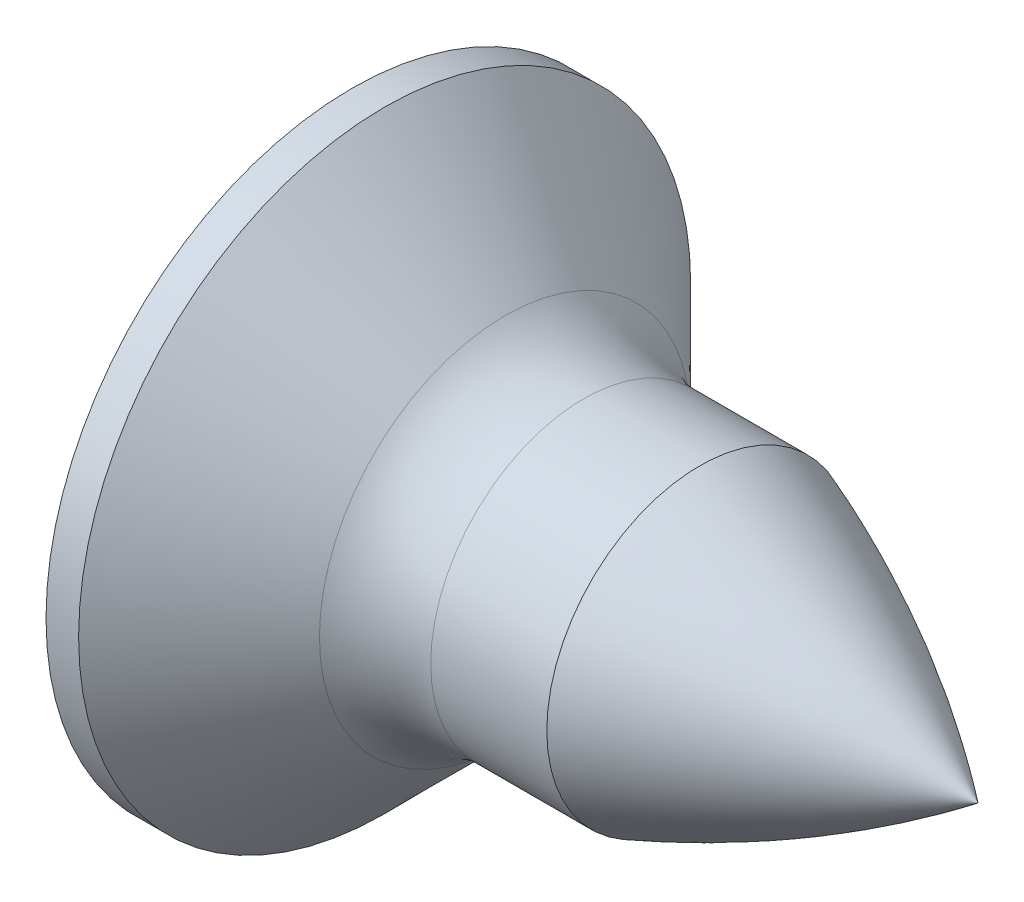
ISO-10303-21;
HEADER;
FILE_DESCRIPTION(('STEP AP214'),'2;1');
FILE_NAME('part.step','',(''),(''),'','','');
FILE_SCHEMA(('AUTOMOTIVE_DESIGN { 1 0 10303 214 1 1 1 1 }'));
ENDSEC;
DATA;
#1=APPLICATION_CONTEXT('core data for automotive mechanical design processes');
#2=APPLICATION_PROTOCOL_DEFINITION('international standard','automotive_design',2000,#1);
#3=PRODUCT_CONTEXT('',#1,'mechanical');
#4=PRODUCT('Part','Part','',(#3));
#5=PRODUCT_RELATED_PRODUCT_CATEGORY('part','',(#4));
#6=PRODUCT_DEFINITION_FORMATION('','',#4);
#7=PRODUCT_DEFINITION_CONTEXT('part definition',#1,'design');
#8=PRODUCT_DEFINITION('design','',#6,#7);
#9=PRODUCT_DEFINITION_SHAPE('','',#8);
#10=(LENGTH_UNIT() NAMED_UNIT(*) SI_UNIT(.MILLI.,.METRE.));
#11=(NAMED_UNIT(*) PLANE_ANGLE_UNIT() SI_UNIT($,.RADIAN.));
#12=(NAMED_UNIT(*) SI_UNIT($,.STERADIAN.) SOLID_ANGLE_UNIT());
#13=UNCERTAINTY_MEASURE_WITH_UNIT(LENGTH_MEASURE(1.E-05),#10,'distance_accuracy_value','');
#14=(GEOMETRIC_REPRESENTATION_CONTEXT(3) GLOBAL_UNCERTAINTY_ASSIGNED_CONTEXT((#13)) GLOBAL_UNIT_ASSIGNED_CONTEXT((#10,
#11,#12)) REPRESENTATION_CONTEXT('',''));
#15=CARTESIAN_POINT('',(0.,0.,0.));
#16=DIRECTION('',(0.,0.,1.));
#17=DIRECTION('',(1.,0.,0.));
#18=AXIS2_PLACEMENT_3D('',#15,#16,#17);
#19=CARTESIAN_POINT('',(-96.3851955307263,0.,0.));
#20=DIRECTION('',(-1.,0.,0.));
#21=DIRECTION('',(0.,0.,1.));
#22=AXIS2_PLACEMENT_3D('',#19,#20,#21);
#23=CYLINDRICAL_SURFACE('',#22,1.09999999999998);
#24=CARTESIAN_POINT('',(1.66568542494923,0.,0.));
#25=DIRECTION('',(-1.,0.,0.));
#26=DIRECTION('',(0.,0.,1.));
#27=AXIS2_PLACEMENT_3D('',#24,#25,#26);
#28=CIRCLE('',#27,1.09999999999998);
#29=CARTESIAN_POINT('',(1.66568542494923,0.,1.09999999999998));
#30=VERTEX_POINT('',#29);
#31=EDGE_CURVE('E11',#30,#30,#28,.T.);
#32=ORIENTED_EDGE('',*,*,#31,.F.);
#33=EDGE_LOOP('',(#32));
#34=FACE_BOUND('',#33,.T.);
#35=CARTESIAN_POINT('',(2.5,0.,0.));
#36=DIRECTION('',(1.,0.,0.));
#37=DIRECTION('',(0.,0.,-1.));
#38=AXIS2_PLACEMENT_3D('',#35,#36,#37);
#39=CIRCLE('',#38,1.1);
#40=CARTESIAN_POINT('',(2.5,0.,-1.09999999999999));
#41=VERTEX_POINT('',#40);
#42=EDGE_CURVE('E286',#41,#41,#39,.T.);
#43=ORIENTED_EDGE('',*,*,#42,.F.);
#44=EDGE_LOOP('',(#43));
#45=FACE_BOUND('',#44,.T.);
#46=ADVANCED_FACE('F37',(#34,#45),#23,.T.);
#47=CARTESIAN_POINT('',(1.66568542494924,0.,0.));
#48=DIRECTION('',(-1.,0.,0.));
#49=DIRECTION('',(0.,0.,1.));
#50=AXIS2_PLACEMENT_3D('',#47,#48,#49);
#51=TOROIDAL_SURFACE('',#50,1.89999999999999,0.800000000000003);
#52=CARTESIAN_POINT('',(1.1,0.,0.));
#53=DIRECTION('',(-1.,0.,0.));
#54=DIRECTION('',(0.,0.,1.));
#55=AXIS2_PLACEMENT_3D('',#52,#53,#54);
#56=CIRCLE('',#55,1.33431457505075);
#57=CARTESIAN_POINT('',(1.1,0.,1.33431457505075));
#58=VERTEX_POINT('',#57);
#59=EDGE_CURVE('E244',#58,#58,#56,.T.);
#60=ORIENTED_EDGE('',*,*,#59,.F.);
#61=EDGE_LOOP('',(#60));
#62=FACE_BOUND('',#61,.T.);
#63=ORIENTED_EDGE('',*,*,#31,.T.);
#64=EDGE_LOOP('',(#63));
#65=FACE_BOUND('',#64,.T.);
#66=ADVANCED_FACE('F155',(#62,#65),#51,.F.);
#67=CARTESIAN_POINT('',(0.,2.19999999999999,0.));
#68=DIRECTION('',(1.,0.,0.));
#69=DIRECTION('',(0.,0.,-1.));
#70=AXIS2_PLACEMENT_3D('',#67,#68,#69);
#71=PLANE('',#70);
#72=DIRECTION('',(0.,0.,-1.));
#73=VECTOR('',#72,1.);
#74=CARTESIAN_POINT('',(-1.13686837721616E-10,0.199999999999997,-0.199999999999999));
#75=LINE('',#74,#73);
#76=CARTESIAN_POINT('',(0.,0.199999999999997,-0.199999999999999));
#77=VERTEX_POINT('',#76);
#78=CARTESIAN_POINT('',(-1.13686837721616E-10,0.199999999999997,-1.));
#79=VERTEX_POINT('',#78);
#80=EDGE_CURVE('E204',#77,#79,#75,.T.);
#81=ORIENTED_EDGE('',*,*,#80,.F.);
#82=DIRECTION('',(0.,-1.,0.));
#83=VECTOR('',#82,1.);
#84=CARTESIAN_POINT('',(-1.13686837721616E-10,1.,-0.199999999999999));
#85=LINE('',#84,#83);
#86=CARTESIAN_POINT('',(-1.13686837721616E-10,1.,-0.199999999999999));
#87=VERTEX_POINT('',#86);
#88=EDGE_CURVE('E56',#87,#77,#85,.T.);
#89=ORIENTED_EDGE('',*,*,#88,.F.);
#90=DIRECTION('',(0.,0.,-1.));
#91=VECTOR('',#90,1.);
#92=CARTESIAN_POINT('',(-1.13686837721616E-10,1.,0.199999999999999));
#93=LINE('',#92,#91);
#94=CARTESIAN_POINT('',(-1.13686837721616E-10,1.,0.199999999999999));
#95=VERTEX_POINT('',#94);
#96=EDGE_CURVE('E232',#95,#87,#93,.T.);
#97=ORIENTED_EDGE('',*,*,#96,.F.);
#98=DIRECTION('',(0.,1.,0.));
#99=VECTOR('',#98,1.);
#100=CARTESIAN_POINT('',(-1.13686837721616E-10,1.,0.199999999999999));
#101=LINE('',#100,#99);
#102=CARTESIAN_POINT('',(-1.13686837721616E-10,0.199999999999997,0.199999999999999));
#103=VERTEX_POINT('',#102);
#104=EDGE_CURVE('E230',#103,#95,#101,.T.);
#105=ORIENTED_EDGE('',*,*,#104,.F.);
#106=DIRECTION('',(0.,0.,-1.));
#107=VECTOR('',#106,1.);
#108=CARTESIAN_POINT('',(-1.13686837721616E-10,0.199999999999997,0.199999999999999));
#109=LINE('',#108,#107);
#110=CARTESIAN_POINT('',(-1.13686837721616E-10,0.199999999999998,1.));
#111=VERTEX_POINT('',#110);
#112=EDGE_CURVE('E227',#111,#103,#109,.T.);
#113=ORIENTED_EDGE('',*,*,#112,.F.);
#114=DIRECTION('',(0.,1.,0.));
#115=VECTOR('',#114,1.);
#116=CARTESIAN_POINT('',(-1.13686837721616E-10,0.199999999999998,1.));
#117=LINE('',#116,#115);
#118=CARTESIAN_POINT('',(-1.13686837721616E-10,-0.199999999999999,1.));
#119=VERTEX_POINT('',#118);
#120=EDGE_CURVE('E224',#119,#111,#117,.T.);
#121=ORIENTED_EDGE('',*,*,#120,.F.);
#122=DIRECTION('',(0.,0.,1.));
#123=VECTOR('',#122,1.);
#124=CARTESIAN_POINT('',(-1.13686837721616E-10,-0.199999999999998,0.199999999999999));
#125=LINE('',#124,#123);
#126=CARTESIAN_POINT('',(-1.13686837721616E-10,-0.199999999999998,0.199999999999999));
#127=VERTEX_POINT('',#126);
#128=EDGE_CURVE('E222',#127,#119,#125,.T.);
#129=ORIENTED_EDGE('',*,*,#128,.F.);
#130=DIRECTION('',(0.,1.,0.));
#131=VECTOR('',#130,1.);
#132=CARTESIAN_POINT('',(-1.13686837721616E-10,-1.,0.199999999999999));
#133=LINE('',#132,#131);
#134=CARTESIAN_POINT('',(-1.13686837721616E-10,-1.,0.199999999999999));
#135=VERTEX_POINT('',#134);
#136=EDGE_CURVE('E220',#135,#127,#133,.T.);
#137=ORIENTED_EDGE('',*,*,#136,.F.);
#138=DIRECTION('',(0.,0.,1.));
#139=VECTOR('',#138,1.);
#140=CARTESIAN_POINT('',(-1.13686837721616E-10,-1.,0.199999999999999));
#141=LINE('',#140,#139);
#142=CARTESIAN_POINT('',(-1.13686837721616E-10,-1.,-0.199999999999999));
#143=VERTEX_POINT('',#142);
#144=EDGE_CURVE('E214',#143,#135,#141,.T.);
#145=ORIENTED_EDGE('',*,*,#144,.F.);
#146=DIRECTION('',(0.,-1.,0.));
#147=VECTOR('',#146,1.);
#148=CARTESIAN_POINT('',(-1.13686837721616E-10,-1.,-0.199999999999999));
#149=LINE('',#148,#147);
#150=CARTESIAN_POINT('',(-1.13686837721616E-10,-0.199999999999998,-0.199999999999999));
#151=VERTEX_POINT('',#150);
#152=EDGE_CURVE('E211',#151,#143,#149,.T.);
#153=ORIENTED_EDGE('',*,*,#152,.F.);
#154=DIRECTION('',(0.,0.,1.));
#155=VECTOR('',#154,1.);
#156=CARTESIAN_POINT('',(-1.13686837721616E-10,-0.199999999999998,-0.199999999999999));
#157=LINE('',#156,#155);
#158=CARTESIAN_POINT('',(-1.13686837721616E-10,-0.2,-1.));
#159=VERTEX_POINT('',#158);
#160=EDGE_CURVE('E203',#159,#151,#157,.T.);
#161=ORIENTED_EDGE('',*,*,#160,.F.);
#162=DIRECTION('',(0.,-1.,0.));
#163=VECTOR('',#162,1.);
#164=CARTESIAN_POINT('',(-1.13686837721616E-10,0.199999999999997,-1.));
#165=LINE('',#164,#163);
#166=EDGE_CURVE('E194',#79,#159,#165,.T.);
#167=ORIENTED_EDGE('',*,*,#166,.F.);
#168=EDGE_LOOP('',(#81,#89,#97,#105,#113,#121,#129,#137,#145,#153,#161,#167));
#169=FACE_BOUND('',#168,.T.);
#170=CARTESIAN_POINT('',(0.,0.,0.));
#171=DIRECTION('',(-1.,0.,0.));
#172=DIRECTION('',(0.,0.,1.));
#173=AXIS2_PLACEMENT_3D('',#170,#171,#172);
#174=CIRCLE('',#173,2.19999999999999);
#175=CARTESIAN_POINT('',(0.,0.,2.19999999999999));
#176=VERTEX_POINT('',#175);
#177=EDGE_CURVE('E47',#176,#176,#174,.T.);
#178=ORIENTED_EDGE('',*,*,#177,.T.);
#179=EDGE_LOOP('',(#178));
#180=FACE_BOUND('',#179,.T.);
#181=ADVANCED_FACE('F161',(#169,#180),#71,.F.);
#182=CARTESIAN_POINT('',(-96.3851955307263,0.,0.));
#183=DIRECTION('',(-1.,0.,0.));
#184=DIRECTION('',(0.,0.,1.));
#185=AXIS2_PLACEMENT_3D('',#182,#183,#184);
#186=CYLINDRICAL_SURFACE('',#185,2.19999999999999);
#187=ORIENTED_EDGE('',*,*,#177,.F.);
#188=EDGE_LOOP('',(#187));
#189=FACE_BOUND('',#188,.T.);
#190=CARTESIAN_POINT('',(0.234314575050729,0.,0.));
#191=DIRECTION('',(-1.,0.,0.));
#192=DIRECTION('',(0.,0.,1.));
#193=AXIS2_PLACEMENT_3D('',#190,#191,#192);
#194=CIRCLE('',#193,2.19999999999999);
#195=CARTESIAN_POINT('',(0.234314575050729,0.,2.19999999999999));
#196=VERTEX_POINT('',#195);
#197=EDGE_CURVE('E247',#196,#196,#194,.T.);
#198=ORIENTED_EDGE('',*,*,#197,.T.);
#199=EDGE_LOOP('',(#198));
#200=FACE_BOUND('',#199,.T.);
#201=ADVANCED_FACE('F322',(#189,#200),#186,.T.);
#202=CARTESIAN_POINT('',(1.1,0.,0.));
#203=DIRECTION('',(-1.,0.,0.));
#204=DIRECTION('',(0.,0.,1.));
#205=AXIS2_PLACEMENT_3D('',#202,#203,#204);
#206=CONICAL_SURFACE('',#205,1.33431457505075,0.78539816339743);
#207=ORIENTED_EDGE('',*,*,#197,.F.);
#208=EDGE_LOOP('',(#207));
#209=FACE_BOUND('',#208,.T.);
#210=ORIENTED_EDGE('',*,*,#59,.T.);
#211=EDGE_LOOP('',(#210));
#212=FACE_BOUND('',#211,.T.);
#213=ADVANCED_FACE('F320',(#209,#212),#206,.T.);
#214=CARTESIAN_POINT('',(0.949999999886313,1.,-0.199999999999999));
#215=DIRECTION('',(0.,0.,-1.));
#216=DIRECTION('',(-1.,0.,0.));
#217=AXIS2_PLACEMENT_3D('',#214,#215,#216);
#218=PLANE('',#217);
#219=ORIENTED_EDGE('',*,*,#88,.T.);
#220=DIRECTION('',(-1.,0.,0.));
#221=VECTOR('',#220,1.);
#222=CARTESIAN_POINT('',(0.949999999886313,0.199999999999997,-0.199999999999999));
#223=LINE('',#222,#221);
#224=CARTESIAN_POINT('',(0.949999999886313,0.199999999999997,-0.199999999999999));
#225=VERTEX_POINT('',#224);
#226=EDGE_CURVE('E137',#225,#77,#223,.T.);
#227=ORIENTED_EDGE('',*,*,#226,.F.);
#228=DIRECTION('',(0.,-1.,0.));
#229=VECTOR('',#228,1.);
#230=CARTESIAN_POINT('',(0.949999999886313,1.,-0.199999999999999));
#231=LINE('',#230,#229);
#232=CARTESIAN_POINT('',(0.949999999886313,0.451517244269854,-0.199999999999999));
#233=VERTEX_POINT('',#232);
#234=EDGE_CURVE('E234',#233,#225,#231,.T.);
#235=ORIENTED_EDGE('',*,*,#234,.F.);
#236=DIRECTION('',(0.866025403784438,-0.500000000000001,0.));
#237=VECTOR('',#236,1.);
#238=CARTESIAN_POINT('',(-1.13686837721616E-10,1.,-0.199999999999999));
#239=LINE('',#238,#237);
#240=EDGE_CURVE('E136',#233,#87,#239,.F.);
#241=ORIENTED_EDGE('',*,*,#240,.T.);
#242=EDGE_LOOP('',(#219,#227,#235,#241));
#243=FACE_BOUND('',#242,.T.);
#244=ADVANCED_FACE('F291',(#243),#218,.F.);
#245=CARTESIAN_POINT('',(-1.13686837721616E-10,1.,0.199999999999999));
#246=DIRECTION('',(-0.500000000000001,-0.866025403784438,0.));
#247=DIRECTION('',(0.866025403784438,-0.500000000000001,0.));
#248=AXIS2_PLACEMENT_3D('',#245,#246,#247);
#249=PLANE('',#248);
#250=ORIENTED_EDGE('',*,*,#96,.T.);
#251=ORIENTED_EDGE('',*,*,#240,.F.);
#252=DIRECTION('',(0.,0.,1.));
#253=VECTOR('',#252,1.);
#254=CARTESIAN_POINT('',(0.949999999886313,0.451517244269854,0.199999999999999));
#255=LINE('',#254,#253);
#256=CARTESIAN_POINT('',(0.949999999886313,0.451517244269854,0.199999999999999));
#257=VERTEX_POINT('',#256);
#258=EDGE_CURVE('E243',#257,#233,#255,.F.);
#259=ORIENTED_EDGE('',*,*,#258,.F.);
#260=DIRECTION('',(0.866025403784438,-0.500000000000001,0.));
#261=VECTOR('',#260,1.);
#262=CARTESIAN_POINT('',(0.712499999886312,0.588637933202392,0.199999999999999));
#263=LINE('',#262,#261);
#264=EDGE_CURVE('E133',#257,#95,#263,.F.);
#265=ORIENTED_EDGE('',*,*,#264,.T.);
#266=EDGE_LOOP('',(#250,#251,#259,#265));
#267=FACE_BOUND('',#266,.T.);
#268=ADVANCED_FACE('F39',(#267),#249,.T.);
#269=CARTESIAN_POINT('',(0.949999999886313,1.,0.199999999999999));
#270=DIRECTION('',(0.,0.,1.));
#271=DIRECTION('',(1.,0.,0.));
#272=AXIS2_PLACEMENT_3D('',#269,#270,#271);
#273=PLANE('',#272);
#274=ORIENTED_EDGE('',*,*,#104,.T.);
#275=ORIENTED_EDGE('',*,*,#264,.F.);
#276=DIRECTION('',(0.,1.,0.));
#277=VECTOR('',#276,1.);
#278=CARTESIAN_POINT('',(0.949999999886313,1.,0.199999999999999));
#279=LINE('',#278,#277);
#280=CARTESIAN_POINT('',(0.949999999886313,0.199999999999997,0.199999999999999));
#281=VERTEX_POINT('',#280);
#282=EDGE_CURVE('E263',#281,#257,#279,.T.);
#283=ORIENTED_EDGE('',*,*,#282,.F.);
#284=DIRECTION('',(-1.,0.,0.));
#285=VECTOR('',#284,1.);
#286=CARTESIAN_POINT('',(0.949999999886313,0.199999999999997,0.199999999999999));
#287=LINE('',#286,#285);
#288=EDGE_CURVE('E235',#281,#103,#287,.T.);
#289=ORIENTED_EDGE('',*,*,#288,.T.);
#290=EDGE_LOOP('',(#274,#275,#283,#289));
#291=FACE_BOUND('',#290,.T.);
#292=ADVANCED_FACE('F297',(#291),#273,.F.);
#293=CARTESIAN_POINT('',(0.949999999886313,0.199999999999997,0.199999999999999));
#294=DIRECTION('',(0.,1.,0.));
#295=DIRECTION('',(0.,0.,1.));
#296=AXIS2_PLACEMENT_3D('',#293,#294,#295);
#297=PLANE('',#296);
#298=ORIENTED_EDGE('',*,*,#112,.T.);
#299=ORIENTED_EDGE('',*,*,#288,.F.);
#300=DIRECTION('',(0.,0.,-1.));
#301=VECTOR('',#300,1.);
#302=CARTESIAN_POINT('',(0.949999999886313,0.199999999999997,0.199999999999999));
#303=LINE('',#302,#301);
#304=CARTESIAN_POINT('',(0.949999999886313,0.199999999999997,0.451517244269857));
#305=VERTEX_POINT('',#304);
#306=EDGE_CURVE('E274',#305,#281,#303,.T.);
#307=ORIENTED_EDGE('',*,*,#306,.F.);
#308=DIRECTION('',(0.866025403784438,0.,-0.500000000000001));
#309=VECTOR('',#308,1.);
#310=CARTESIAN_POINT('',(-1.13686837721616E-10,0.199999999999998,1.));
#311=LINE('',#310,#309);
#312=EDGE_CURVE('E41',#305,#111,#311,.F.);
#313=ORIENTED_EDGE('',*,*,#312,.T.);
#314=EDGE_LOOP('',(#298,#299,#307,#313));
#315=FACE_BOUND('',#314,.T.);
#316=ADVANCED_FACE('F178',(#315),#297,.F.);
#317=CARTESIAN_POINT('',(-1.13686837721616E-10,0.199999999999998,1.));
#318=DIRECTION('',(-0.500000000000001,0.,-0.866025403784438));
#319=DIRECTION('',(-0.866025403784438,0.,0.500000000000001));
#320=AXIS2_PLACEMENT_3D('',#317,#318,#319);
#321=PLANE('',#320);
#322=ORIENTED_EDGE('',*,*,#120,.T.);
#323=ORIENTED_EDGE('',*,*,#312,.F.);
#324=DIRECTION('',(0.,-1.,0.));
#325=VECTOR('',#324,1.);
#326=CARTESIAN_POINT('',(0.949999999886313,0.199999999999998,0.451517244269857));
#327=LINE('',#326,#325);
#328=CARTESIAN_POINT('',(0.949999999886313,-0.199999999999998,0.451517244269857));
#329=VERTEX_POINT('',#328);
#330=EDGE_CURVE('E272',#329,#305,#327,.F.);
#331=ORIENTED_EDGE('',*,*,#330,.F.);
#332=DIRECTION('',(0.866025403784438,0.,-0.500000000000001));
#333=VECTOR('',#332,1.);
#334=CARTESIAN_POINT('',(1.05891016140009,-0.199999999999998,0.388637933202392));
#335=LINE('',#334,#333);
#336=EDGE_CURVE('E88',#329,#119,#335,.F.);
#337=ORIENTED_EDGE('',*,*,#336,.T.);
#338=EDGE_LOOP('',(#322,#323,#331,#337));
#339=FACE_BOUND('',#338,.T.);
#340=ADVANCED_FACE('F175',(#339),#321,.T.);
#341=CARTESIAN_POINT('',(0.949999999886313,-0.199999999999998,0.199999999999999));
#342=DIRECTION('',(0.,-1.,0.));
#343=DIRECTION('',(0.,0.,-1.));
#344=AXIS2_PLACEMENT_3D('',#341,#342,#343);
#345=PLANE('',#344);
#346=ORIENTED_EDGE('',*,*,#128,.T.);
#347=ORIENTED_EDGE('',*,*,#336,.F.);
#348=DIRECTION('',(0.,0.,1.));
#349=VECTOR('',#348,1.);
#350=CARTESIAN_POINT('',(0.949999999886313,-0.199999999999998,0.199999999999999));
#351=LINE('',#350,#349);
#352=CARTESIAN_POINT('',(0.949999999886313,-0.199999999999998,0.199999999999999));
#353=VERTEX_POINT('',#352);
#354=EDGE_CURVE('E275',#353,#329,#351,.T.);
#355=ORIENTED_EDGE('',*,*,#354,.F.);
#356=DIRECTION('',(-1.,0.,0.));
#357=VECTOR('',#356,1.);
#358=CARTESIAN_POINT('',(0.949999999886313,-0.199999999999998,0.199999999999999));
#359=LINE('',#358,#357);
#360=EDGE_CURVE('E97',#353,#127,#359,.T.);
#361=ORIENTED_EDGE('',*,*,#360,.T.);
#362=EDGE_LOOP('',(#346,#347,#355,#361));
#363=FACE_BOUND('',#362,.T.);
#364=ADVANCED_FACE('F177',(#363),#345,.F.);
#365=CARTESIAN_POINT('',(0.949999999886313,-1.,0.199999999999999));
#366=DIRECTION('',(0.,0.,1.));
#367=DIRECTION('',(1.,0.,0.));
#368=AXIS2_PLACEMENT_3D('',#365,#366,#367);
#369=PLANE('',#368);
#370=ORIENTED_EDGE('',*,*,#136,.T.);
#371=ORIENTED_EDGE('',*,*,#360,.F.);
#372=DIRECTION('',(0.,1.,0.));
#373=VECTOR('',#372,1.);
#374=CARTESIAN_POINT('',(0.949999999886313,-1.,0.199999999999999));
#375=LINE('',#374,#373);
#376=CARTESIAN_POINT('',(0.949999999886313,-0.451517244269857,0.199999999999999));
#377=VERTEX_POINT('',#376);
#378=EDGE_CURVE('E257',#377,#353,#375,.T.);
#379=ORIENTED_EDGE('',*,*,#378,.F.);
#380=DIRECTION('',(0.866025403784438,0.500000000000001,0.));
#381=VECTOR('',#380,1.);
#382=CARTESIAN_POINT('',(-1.13686837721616E-10,-1.,0.199999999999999));
#383=LINE('',#382,#381);
#384=EDGE_CURVE('E238',#377,#135,#383,.F.);
#385=ORIENTED_EDGE('',*,*,#384,.T.);
#386=EDGE_LOOP('',(#370,#371,#379,#385));
#387=FACE_BOUND('',#386,.T.);
#388=ADVANCED_FACE('F173',(#387),#369,.F.);
#389=CARTESIAN_POINT('',(-1.13686837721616E-10,-1.,0.199999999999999));
#390=DIRECTION('',(-0.500000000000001,0.866025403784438,0.));
#391=DIRECTION('',(-0.866025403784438,-0.500000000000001,0.));
#392=AXIS2_PLACEMENT_3D('',#389,#390,#391);
#393=PLANE('',#392);
#394=ORIENTED_EDGE('',*,*,#144,.T.);
#395=ORIENTED_EDGE('',*,*,#384,.F.);
#396=DIRECTION('',(0.,0.,-1.));
#397=VECTOR('',#396,1.);
#398=CARTESIAN_POINT('',(0.949999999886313,-0.451517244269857,0.199999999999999));
#399=LINE('',#398,#397);
#400=CARTESIAN_POINT('',(0.949999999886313,-0.451517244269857,-0.199999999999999));
#401=VERTEX_POINT('',#400);
#402=EDGE_CURVE('E254',#401,#377,#399,.F.);
#403=ORIENTED_EDGE('',*,*,#402,.F.);
#404=DIRECTION('',(0.866025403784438,0.500000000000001,0.));
#405=VECTOR('',#404,1.);
#406=CARTESIAN_POINT('',(0.712499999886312,-0.588637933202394,-0.199999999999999));
#407=LINE('',#406,#405);
#408=EDGE_CURVE('E241',#401,#143,#407,.F.);
#409=ORIENTED_EDGE('',*,*,#408,.T.);
#410=EDGE_LOOP('',(#394,#395,#403,#409));
#411=FACE_BOUND('',#410,.T.);
#412=ADVANCED_FACE('F169',(#411),#393,.T.);
#413=CARTESIAN_POINT('',(0.949999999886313,-1.,-0.199999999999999));
#414=DIRECTION('',(0.,0.,-1.));
#415=DIRECTION('',(-1.,0.,0.));
#416=AXIS2_PLACEMENT_3D('',#413,#414,#415);
#417=PLANE('',#416);
#418=ORIENTED_EDGE('',*,*,#152,.T.);
#419=ORIENTED_EDGE('',*,*,#408,.F.);
#420=DIRECTION('',(0.,-1.,0.));
#421=VECTOR('',#420,1.);
#422=CARTESIAN_POINT('',(0.949999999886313,-1.,-0.199999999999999));
#423=LINE('',#422,#421);
#424=CARTESIAN_POINT('',(0.949999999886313,-0.199999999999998,-0.199999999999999));
#425=VERTEX_POINT('',#424);
#426=EDGE_CURVE('E258',#425,#401,#423,.T.);
#427=ORIENTED_EDGE('',*,*,#426,.F.);
#428=DIRECTION('',(-1.,0.,0.));
#429=VECTOR('',#428,1.);
#430=CARTESIAN_POINT('',(0.949999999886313,-0.199999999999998,-0.199999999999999));
#431=LINE('',#430,#429);
#432=EDGE_CURVE('E239',#425,#151,#431,.T.);
#433=ORIENTED_EDGE('',*,*,#432,.T.);
#434=EDGE_LOOP('',(#418,#419,#427,#433));
#435=FACE_BOUND('',#434,.T.);
#436=ADVANCED_FACE('F172',(#435),#417,.F.);
#437=CARTESIAN_POINT('',(0.949999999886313,-0.199999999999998,-0.199999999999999));
#438=DIRECTION('',(0.,-1.,0.));
#439=DIRECTION('',(0.,0.,-1.));
#440=AXIS2_PLACEMENT_3D('',#437,#438,#439);
#441=PLANE('',#440);
#442=ORIENTED_EDGE('',*,*,#160,.T.);
#443=ORIENTED_EDGE('',*,*,#432,.F.);
#444=DIRECTION('',(0.,0.,1.));
#445=VECTOR('',#444,1.);
#446=CARTESIAN_POINT('',(0.949999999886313,-0.199999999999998,-0.199999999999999));
#447=LINE('',#446,#445);
#448=CARTESIAN_POINT('',(0.949999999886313,-0.199999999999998,-0.451517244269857));
#449=VERTEX_POINT('',#448);
#450=EDGE_CURVE('E269',#449,#425,#447,.T.);
#451=ORIENTED_EDGE('',*,*,#450,.F.);
#452=DIRECTION('',(0.866025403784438,0.,0.500000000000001));
#453=VECTOR('',#452,1.);
#454=CARTESIAN_POINT('',(-1.13686415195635E-10,-0.2,-1.));
#455=LINE('',#454,#453);
#456=EDGE_CURVE('E197',#449,#159,#455,.F.);
#457=ORIENTED_EDGE('',*,*,#456,.T.);
#458=EDGE_LOOP('',(#442,#443,#451,#457));
#459=FACE_BOUND('',#458,.T.);
#460=ADVANCED_FACE('F182',(#459),#441,.F.);
#461=CARTESIAN_POINT('',(-1.13686837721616E-10,0.199999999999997,-1.));
#462=DIRECTION('',(-0.500000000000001,0.,0.866025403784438));
#463=DIRECTION('',(0.866025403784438,0.,0.500000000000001));
#464=AXIS2_PLACEMENT_3D('',#461,#462,#463);
#465=PLANE('',#464);
#466=ORIENTED_EDGE('',*,*,#166,.T.);
#467=ORIENTED_EDGE('',*,*,#456,.F.);
#468=DIRECTION('',(0.,1.,0.));
#469=VECTOR('',#468,1.);
#470=CARTESIAN_POINT('',(0.949999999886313,0.199999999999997,-0.451517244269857));
#471=LINE('',#470,#469);
#472=CARTESIAN_POINT('',(0.949999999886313,0.199999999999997,-0.451517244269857));
#473=VERTEX_POINT('',#472);
#474=EDGE_CURVE('E266',#473,#449,#471,.F.);
#475=ORIENTED_EDGE('',*,*,#474,.F.);
#476=DIRECTION('',(0.866025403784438,0.,0.500000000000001));
#477=VECTOR('',#476,1.);
#478=CARTESIAN_POINT('',(1.05891016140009,0.199999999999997,-0.388637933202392));
#479=LINE('',#478,#477);
#480=EDGE_CURVE('E199',#473,#79,#479,.F.);
#481=ORIENTED_EDGE('',*,*,#480,.T.);
#482=EDGE_LOOP('',(#466,#467,#475,#481));
#483=FACE_BOUND('',#482,.T.);
#484=ADVANCED_FACE('F180',(#483),#465,.T.);
#485=CARTESIAN_POINT('',(0.949999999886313,0.199999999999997,-0.199999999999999));
#486=DIRECTION('',(0.,1.,0.));
#487=DIRECTION('',(0.,0.,1.));
#488=AXIS2_PLACEMENT_3D('',#485,#486,#487);
#489=PLANE('',#488);
#490=ORIENTED_EDGE('',*,*,#80,.T.);
#491=ORIENTED_EDGE('',*,*,#480,.F.);
#492=DIRECTION('',(0.,0.,-1.));
#493=VECTOR('',#492,1.);
#494=CARTESIAN_POINT('',(0.949999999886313,0.199999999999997,-0.199999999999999));
#495=LINE('',#494,#493);
#496=EDGE_CURVE('E270',#225,#473,#495,.T.);
#497=ORIENTED_EDGE('',*,*,#496,.F.);
#498=ORIENTED_EDGE('',*,*,#226,.T.);
#499=EDGE_LOOP('',(#490,#491,#497,#498));
#500=FACE_BOUND('',#499,.T.);
#501=ADVANCED_FACE('F150',(#500),#489,.F.);
#502=CARTESIAN_POINT('',(0.949999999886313,-1.,-0.199999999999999));
#503=DIRECTION('',(1.,0.,0.));
#504=DIRECTION('',(0.,0.,-1.));
#505=AXIS2_PLACEMENT_3D('',#502,#503,#504);
#506=PLANE('',#505);
#507=ORIENTED_EDGE('',*,*,#234,.T.);
#508=ORIENTED_EDGE('',*,*,#496,.T.);
#509=ORIENTED_EDGE('',*,*,#474,.T.);
#510=ORIENTED_EDGE('',*,*,#450,.T.);
#511=ORIENTED_EDGE('',*,*,#426,.T.);
#512=ORIENTED_EDGE('',*,*,#402,.T.);
#513=ORIENTED_EDGE('',*,*,#378,.T.);
#514=ORIENTED_EDGE('',*,*,#354,.T.);
#515=ORIENTED_EDGE('',*,*,#330,.T.);
#516=ORIENTED_EDGE('',*,*,#306,.T.);
#517=ORIENTED_EDGE('',*,*,#282,.T.);
#518=ORIENTED_EDGE('',*,*,#258,.T.);
#519=EDGE_LOOP('',(#507,#508,#509,#510,#511,#512,#513,#514,#515,#516,#517,#518));
#520=FACE_BOUND('',#519,.T.);
#521=ADVANCED_FACE('F144',(#520),#506,.F.);
#522=CARTESIAN_POINT('',(-0.315917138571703,0.,6.38803116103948));
#523=DIRECTION('',(0.,-1.,0.));
#524=DIRECTION('',(0.,0.,-1.));
#525=AXIS2_PLACEMENT_3D('',#522,#523,#524);
#526=CIRCLE('',#525,8.);
#527=TRIMMED_CURVE('',#526,(PARAMETER_VALUE(-0.645990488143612)),
(PARAMETER_VALUE(0.645990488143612)),.T.,.PARAMETER.);
#528=CARTESIAN_POINT('',(-0.315917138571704,0.,0.));
#529=DIRECTION('',(1.,0.,0.));
#530=AXIS1_PLACEMENT('',#528,#529);
#531=SURFACE_OF_REVOLUTION('',#527,#530);
#532=ORIENTED_EDGE('',*,*,#42,.T.);
#533=EDGE_LOOP('',(#532));
#534=FACE_BOUND('',#533,.T.);
#535=CARTESIAN_POINT('',(4.5,0.,0.));
#536=VERTEX_POINT('',#535);
#537=VERTEX_LOOP('',#536);
#538=FACE_BOUND('',#537,.T.);
#539=ADVANCED_FACE('F142',(#534,#538),#531,.T.);
#540=CLOSED_SHELL('',(#46,#66,#181,#201,#213,#244,#268,#292,#316,#340,#364,#388,#412,#436,#460,
#484,#501,#521,#539));
#541=MANIFOLD_SOLID_BREP('B2',#540);
#542=ADVANCED_BREP_SHAPE_REPRESENTATION('',(#18,#541),#14);
#543=SHAPE_DEFINITION_REPRESENTATION(#9,#542);
ENDSEC;
END-ISO-10303-21;
